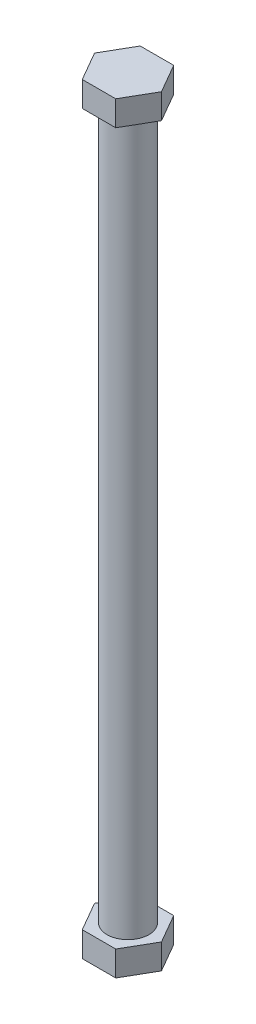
ISO-10303-21;
HEADER;
FILE_DESCRIPTION(('STEP AP214'),'2;1');
FILE_NAME('part.step','',(''),(''),'','','');
FILE_SCHEMA(('AUTOMOTIVE_DESIGN { 1 0 10303 214 1 1 1 1 }'));
ENDSEC;
DATA;
#1=APPLICATION_CONTEXT('core data for automotive mechanical design processes');
#2=APPLICATION_PROTOCOL_DEFINITION('international standard','automotive_design',2000,#1);
#3=PRODUCT_CONTEXT('',#1,'mechanical');
#4=PRODUCT('Part','Part','',(#3));
#5=PRODUCT_RELATED_PRODUCT_CATEGORY('part','',(#4));
#6=PRODUCT_DEFINITION_FORMATION('','',#4);
#7=PRODUCT_DEFINITION_CONTEXT('part definition',#1,'design');
#8=PRODUCT_DEFINITION('design','',#6,#7);
#9=PRODUCT_DEFINITION_SHAPE('','',#8);
#10=(LENGTH_UNIT() NAMED_UNIT(*) SI_UNIT(.MILLI.,.METRE.));
#11=(NAMED_UNIT(*) PLANE_ANGLE_UNIT() SI_UNIT($,.RADIAN.));
#12=(NAMED_UNIT(*) SI_UNIT($,.STERADIAN.) SOLID_ANGLE_UNIT());
#13=UNCERTAINTY_MEASURE_WITH_UNIT(LENGTH_MEASURE(1.E-05),#10,'distance_accuracy_value','');
#14=(GEOMETRIC_REPRESENTATION_CONTEXT(3) GLOBAL_UNCERTAINTY_ASSIGNED_CONTEXT((#13)) GLOBAL_UNIT_ASSIGNED_CONTEXT((#10,
#11,#12)) REPRESENTATION_CONTEXT('',''));
#15=CARTESIAN_POINT('',(0.,0.,0.));
#16=DIRECTION('',(0.,0.,1.));
#17=DIRECTION('',(1.,0.,0.));
#18=AXIS2_PLACEMENT_3D('',#15,#16,#17);
#19=CARTESIAN_POINT('',(0.,-107.95,0.));
#20=DIRECTION('',(0.,1.,0.));
#21=DIRECTION('',(0.,0.,1.));
#22=AXIS2_PLACEMENT_3D('',#19,#20,#21);
#23=CYLINDRICAL_SURFACE('',#22,3.175);
#24=CARTESIAN_POINT('',(0.,-107.95,0.));
#25=DIRECTION('',(0.,1.,0.));
#26=DIRECTION('',(0.,0.,1.));
#27=AXIS2_PLACEMENT_3D('',#24,#25,#26);
#28=CIRCLE('',#27,3.175);
#29=CARTESIAN_POINT('',(0.,-107.95,3.175));
#30=VERTEX_POINT('',#29);
#31=EDGE_CURVE('E136',#30,#30,#28,.T.);
#32=ORIENTED_EDGE('',*,*,#31,.T.);
#33=EDGE_LOOP('',(#32));
#34=FACE_BOUND('',#33,.T.);
#35=CARTESIAN_POINT('',(0.,0.,0.));
#36=DIRECTION('',(0.,1.,0.));
#37=DIRECTION('',(0.,0.,1.));
#38=AXIS2_PLACEMENT_3D('',#35,#36,#37);
#39=CIRCLE('',#38,3.175);
#40=CARTESIAN_POINT('',(0.,0.,3.175));
#41=VERTEX_POINT('',#40);
#42=EDGE_CURVE('E11',#41,#41,#39,.T.);
#43=ORIENTED_EDGE('',*,*,#42,.F.);
#44=EDGE_LOOP('',(#43));
#45=FACE_BOUND('',#44,.T.);
#46=ADVANCED_FACE('F43',(#34,#45),#23,.T.);
#47=CARTESIAN_POINT('',(5.08,3.81,0.));
#48=DIRECTION('',(-0.866025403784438,0.,0.500000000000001));
#49=DIRECTION('',(0.500000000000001,0.,0.866025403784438));
#50=AXIS2_PLACEMENT_3D('',#47,#48,#49);
#51=PLANE('',#50);
#52=DIRECTION('',(-0.500000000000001,0.,-0.866025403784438));
#53=VECTOR('',#52,1.);
#54=CARTESIAN_POINT('',(5.08,0.,0.));
#55=LINE('',#54,#53);
#56=CARTESIAN_POINT('',(5.08,0.,0.));
#57=VERTEX_POINT('',#56);
#58=CARTESIAN_POINT('',(2.54,0.,-4.39940905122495));
#59=VERTEX_POINT('',#58);
#60=EDGE_CURVE('E132',#57,#59,#55,.T.);
#61=ORIENTED_EDGE('',*,*,#60,.T.);
#62=DIRECTION('',(0.,-1.,0.));
#63=VECTOR('',#62,1.);
#64=CARTESIAN_POINT('',(2.54,3.81,-4.39940905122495));
#65=LINE('',#64,#63);
#66=CARTESIAN_POINT('',(2.54,3.81,-4.39940905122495));
#67=VERTEX_POINT('',#66);
#68=EDGE_CURVE('E51',#67,#59,#65,.T.);
#69=ORIENTED_EDGE('',*,*,#68,.F.);
#70=DIRECTION('',(-0.500000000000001,0.,-0.866025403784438));
#71=VECTOR('',#70,1.);
#72=CARTESIAN_POINT('',(5.08,3.81,0.));
#73=LINE('',#72,#71);
#74=CARTESIAN_POINT('',(5.08,3.81,0.));
#75=VERTEX_POINT('',#74);
#76=EDGE_CURVE('E143',#75,#67,#73,.T.);
#77=ORIENTED_EDGE('',*,*,#76,.F.);
#78=DIRECTION('',(0.,-1.,0.));
#79=VECTOR('',#78,1.);
#80=CARTESIAN_POINT('',(5.08,3.81,0.));
#81=LINE('',#80,#79);
#82=EDGE_CURVE('E128',#75,#57,#81,.T.);
#83=ORIENTED_EDGE('',*,*,#82,.T.);
#84=EDGE_LOOP('',(#61,#69,#77,#83));
#85=FACE_BOUND('',#84,.T.);
#86=ADVANCED_FACE('F179',(#85),#51,.F.);
#87=CARTESIAN_POINT('',(2.54,3.81,-4.39940905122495));
#88=DIRECTION('',(0.,0.,1.));
#89=DIRECTION('',(1.,0.,0.));
#90=AXIS2_PLACEMENT_3D('',#87,#88,#89);
#91=PLANE('',#90);
#92=DIRECTION('',(-1.,0.,0.));
#93=VECTOR('',#92,1.);
#94=CARTESIAN_POINT('',(2.54,0.,-4.39940905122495));
#95=LINE('',#94,#93);
#96=CARTESIAN_POINT('',(-2.54,0.,-4.39940905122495));
#97=VERTEX_POINT('',#96);
#98=EDGE_CURVE('E135',#59,#97,#95,.T.);
#99=ORIENTED_EDGE('',*,*,#98,.T.);
#100=DIRECTION('',(0.,-1.,0.));
#101=VECTOR('',#100,1.);
#102=CARTESIAN_POINT('',(-2.54,3.81,-4.39940905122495));
#103=LINE('',#102,#101);
#104=CARTESIAN_POINT('',(-2.54,3.81,-4.39940905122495));
#105=VERTEX_POINT('',#104);
#106=EDGE_CURVE('E147',#105,#97,#103,.T.);
#107=ORIENTED_EDGE('',*,*,#106,.F.);
#108=DIRECTION('',(-1.,0.,0.));
#109=VECTOR('',#108,1.);
#110=CARTESIAN_POINT('',(2.54,3.81,-4.39940905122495));
#111=LINE('',#110,#109);
#112=EDGE_CURVE('E98',#67,#105,#111,.T.);
#113=ORIENTED_EDGE('',*,*,#112,.F.);
#114=ORIENTED_EDGE('',*,*,#68,.T.);
#115=EDGE_LOOP('',(#99,#107,#113,#114));
#116=FACE_BOUND('',#115,.T.);
#117=ADVANCED_FACE('F171',(#116),#91,.F.);
#118=CARTESIAN_POINT('',(-2.54,3.81,-4.39940905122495));
#119=DIRECTION('',(0.866025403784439,0.,0.5));
#120=DIRECTION('',(0.5,0.,-0.866025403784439));
#121=AXIS2_PLACEMENT_3D('',#118,#119,#120);
#122=PLANE('',#121);
#123=DIRECTION('',(-0.5,0.,0.866025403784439));
#124=VECTOR('',#123,1.);
#125=CARTESIAN_POINT('',(-2.54,0.,-4.39940905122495));
#126=LINE('',#125,#124);
#127=CARTESIAN_POINT('',(-5.08,0.,0.));
#128=VERTEX_POINT('',#127);
#129=EDGE_CURVE('E138',#97,#128,#126,.T.);
#130=ORIENTED_EDGE('',*,*,#129,.T.);
#131=DIRECTION('',(0.,-1.,0.));
#132=VECTOR('',#131,1.);
#133=CARTESIAN_POINT('',(-5.08,3.81,0.));
#134=LINE('',#133,#132);
#135=CARTESIAN_POINT('',(-5.08,3.81,0.));
#136=VERTEX_POINT('',#135);
#137=EDGE_CURVE('E123',#136,#128,#134,.T.);
#138=ORIENTED_EDGE('',*,*,#137,.F.);
#139=DIRECTION('',(-0.5,0.,0.866025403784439));
#140=VECTOR('',#139,1.);
#141=CARTESIAN_POINT('',(-2.54,3.81,-4.39940905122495));
#142=LINE('',#141,#140);
#143=EDGE_CURVE('E114',#105,#136,#142,.T.);
#144=ORIENTED_EDGE('',*,*,#143,.F.);
#145=ORIENTED_EDGE('',*,*,#106,.T.);
#146=EDGE_LOOP('',(#130,#138,#144,#145));
#147=FACE_BOUND('',#146,.T.);
#148=ADVANCED_FACE('F174',(#147),#122,.F.);
#149=CARTESIAN_POINT('',(-5.08,3.81,0.));
#150=DIRECTION('',(0.866025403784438,0.,-0.5));
#151=DIRECTION('',(-0.5,0.,-0.866025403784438));
#152=AXIS2_PLACEMENT_3D('',#149,#150,#151);
#153=PLANE('',#152);
#154=DIRECTION('',(0.5,0.,0.866025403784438));
#155=VECTOR('',#154,1.);
#156=CARTESIAN_POINT('',(-5.08,0.,0.));
#157=LINE('',#156,#155);
#158=CARTESIAN_POINT('',(-2.53999999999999,0.,4.39940905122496));
#159=VERTEX_POINT('',#158);
#160=EDGE_CURVE('E122',#128,#159,#157,.T.);
#161=ORIENTED_EDGE('',*,*,#160,.T.);
#162=DIRECTION('',(0.,-1.,0.));
#163=VECTOR('',#162,1.);
#164=CARTESIAN_POINT('',(-2.53999999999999,3.81,4.39940905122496));
#165=LINE('',#164,#163);
#166=CARTESIAN_POINT('',(-2.53999999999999,3.81,4.39940905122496));
#167=VERTEX_POINT('',#166);
#168=EDGE_CURVE('E119',#167,#159,#165,.T.);
#169=ORIENTED_EDGE('',*,*,#168,.F.);
#170=DIRECTION('',(0.5,0.,0.866025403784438));
#171=VECTOR('',#170,1.);
#172=CARTESIAN_POINT('',(-5.08,3.81,0.));
#173=LINE('',#172,#171);
#174=EDGE_CURVE('E108',#136,#167,#173,.T.);
#175=ORIENTED_EDGE('',*,*,#174,.F.);
#176=ORIENTED_EDGE('',*,*,#137,.T.);
#177=EDGE_LOOP('',(#161,#169,#175,#176));
#178=FACE_BOUND('',#177,.T.);
#179=ADVANCED_FACE('F120',(#178),#153,.F.);
#180=CARTESIAN_POINT('',(-2.53999999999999,3.81,4.39940905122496));
#181=DIRECTION('',(0.,0.,-1.));
#182=DIRECTION('',(-1.,0.,0.));
#183=AXIS2_PLACEMENT_3D('',#180,#181,#182);
#184=PLANE('',#183);
#185=DIRECTION('',(1.,0.,0.));
#186=VECTOR('',#185,1.);
#187=CARTESIAN_POINT('',(-2.53999999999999,0.,4.39940905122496));
#188=LINE('',#187,#186);
#189=CARTESIAN_POINT('',(2.54,0.,4.39940905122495));
#190=VERTEX_POINT('',#189);
#191=EDGE_CURVE('E83',#159,#190,#188,.T.);
#192=ORIENTED_EDGE('',*,*,#191,.T.);
#193=DIRECTION('',(0.,-1.,0.));
#194=VECTOR('',#193,1.);
#195=CARTESIAN_POINT('',(2.54,3.81,4.39940905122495));
#196=LINE('',#195,#194);
#197=CARTESIAN_POINT('',(2.54,3.81,4.39940905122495));
#198=VERTEX_POINT('',#197);
#199=EDGE_CURVE('E124',#198,#190,#196,.T.);
#200=ORIENTED_EDGE('',*,*,#199,.F.);
#201=DIRECTION('',(1.,0.,0.));
#202=VECTOR('',#201,1.);
#203=CARTESIAN_POINT('',(-2.53999999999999,3.81,4.39940905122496));
#204=LINE('',#203,#202);
#205=EDGE_CURVE('E112',#167,#198,#204,.T.);
#206=ORIENTED_EDGE('',*,*,#205,.F.);
#207=ORIENTED_EDGE('',*,*,#168,.T.);
#208=EDGE_LOOP('',(#192,#200,#206,#207));
#209=FACE_BOUND('',#208,.T.);
#210=ADVANCED_FACE('F126',(#209),#184,.F.);
#211=CARTESIAN_POINT('',(2.54,3.81,4.39940905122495));
#212=DIRECTION('',(-0.866025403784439,0.,-0.5));
#213=DIRECTION('',(-0.5,0.,0.866025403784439));
#214=AXIS2_PLACEMENT_3D('',#211,#212,#213);
#215=PLANE('',#214);
#216=DIRECTION('',(0.5,0.,-0.866025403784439));
#217=VECTOR('',#216,1.);
#218=CARTESIAN_POINT('',(2.54,0.,4.39940905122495));
#219=LINE('',#218,#217);
#220=EDGE_CURVE('E89',#190,#57,#219,.T.);
#221=ORIENTED_EDGE('',*,*,#220,.T.);
#222=ORIENTED_EDGE('',*,*,#82,.F.);
#223=DIRECTION('',(0.5,0.,-0.866025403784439));
#224=VECTOR('',#223,1.);
#225=CARTESIAN_POINT('',(2.54,3.81,4.39940905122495));
#226=LINE('',#225,#224);
#227=EDGE_CURVE('E59',#198,#75,#226,.T.);
#228=ORIENTED_EDGE('',*,*,#227,.F.);
#229=ORIENTED_EDGE('',*,*,#199,.T.);
#230=EDGE_LOOP('',(#221,#222,#228,#229));
#231=FACE_BOUND('',#230,.T.);
#232=ADVANCED_FACE('F180',(#231),#215,.F.);
#233=CARTESIAN_POINT('',(0.,3.81,0.));
#234=DIRECTION('',(0.,1.,0.));
#235=DIRECTION('',(0.,0.,1.));
#236=AXIS2_PLACEMENT_3D('',#233,#234,#235);
#237=PLANE('',#236);
#238=ORIENTED_EDGE('',*,*,#76,.T.);
#239=ORIENTED_EDGE('',*,*,#112,.T.);
#240=ORIENTED_EDGE('',*,*,#143,.T.);
#241=ORIENTED_EDGE('',*,*,#174,.T.);
#242=ORIENTED_EDGE('',*,*,#205,.T.);
#243=ORIENTED_EDGE('',*,*,#227,.T.);
#244=EDGE_LOOP('',(#238,#239,#240,#241,#242,#243));
#245=FACE_BOUND('',#244,.T.);
#246=ADVANCED_FACE('F110',(#245),#237,.T.);
#247=CARTESIAN_POINT('',(0.,0.,0.));
#248=DIRECTION('',(0.,1.,0.));
#249=DIRECTION('',(0.,0.,1.));
#250=AXIS2_PLACEMENT_3D('',#247,#248,#249);
#251=PLANE('',#250);
#252=ORIENTED_EDGE('',*,*,#42,.T.);
#253=EDGE_LOOP('',(#252));
#254=FACE_BOUND('',#253,.T.);
#255=ORIENTED_EDGE('',*,*,#60,.F.);
#256=ORIENTED_EDGE('',*,*,#220,.F.);
#257=ORIENTED_EDGE('',*,*,#191,.F.);
#258=ORIENTED_EDGE('',*,*,#160,.F.);
#259=ORIENTED_EDGE('',*,*,#129,.F.);
#260=ORIENTED_EDGE('',*,*,#98,.F.);
#261=EDGE_LOOP('',(#255,#256,#257,#258,#259,#260));
#262=FACE_BOUND('',#261,.T.);
#263=ADVANCED_FACE('F177',(#254,#262),#251,.F.);
#264=CARTESIAN_POINT('',(5.08,-111.76,0.));
#265=DIRECTION('',(-0.866025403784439,0.,-0.499999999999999));
#266=DIRECTION('',(-0.499999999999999,0.,0.866025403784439));
#267=AXIS2_PLACEMENT_3D('',#264,#265,#266);
#268=PLANE('',#267);
#269=DIRECTION('',(-0.499999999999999,0.,0.866025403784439));
#270=VECTOR('',#269,1.);
#271=CARTESIAN_POINT('',(5.08,-107.95,0.));
#272=LINE('',#271,#270);
#273=CARTESIAN_POINT('',(5.08,-107.95,0.));
#274=VERTEX_POINT('',#273);
#275=CARTESIAN_POINT('',(2.54000000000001,-107.95,4.39940905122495));
#276=VERTEX_POINT('',#275);
#277=EDGE_CURVE('E252',#274,#276,#272,.T.);
#278=ORIENTED_EDGE('',*,*,#277,.T.);
#279=DIRECTION('',(0.,1.,0.));
#280=VECTOR('',#279,1.);
#281=CARTESIAN_POINT('',(2.54000000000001,-111.76,4.39940905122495));
#282=LINE('',#281,#280);
#283=CARTESIAN_POINT('',(2.54000000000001,-111.76,4.39940905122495));
#284=VERTEX_POINT('',#283);
#285=EDGE_CURVE('E151',#284,#276,#282,.T.);
#286=ORIENTED_EDGE('',*,*,#285,.F.);
#287=DIRECTION('',(-0.499999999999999,0.,0.866025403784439));
#288=VECTOR('',#287,1.);
#289=CARTESIAN_POINT('',(5.08,-111.76,0.));
#290=LINE('',#289,#288);
#291=CARTESIAN_POINT('',(5.08,-111.76,0.));
#292=VERTEX_POINT('',#291);
#293=EDGE_CURVE('E238',#292,#284,#290,.T.);
#294=ORIENTED_EDGE('',*,*,#293,.F.);
#295=DIRECTION('',(0.,1.,0.));
#296=VECTOR('',#295,1.);
#297=CARTESIAN_POINT('',(5.08,-111.76,0.));
#298=LINE('',#297,#296);
#299=EDGE_CURVE('E253',#292,#274,#298,.T.);
#300=ORIENTED_EDGE('',*,*,#299,.T.);
#301=EDGE_LOOP('',(#278,#286,#294,#300));
#302=FACE_BOUND('',#301,.T.);
#303=ADVANCED_FACE('F198',(#302),#268,.F.);
#304=CARTESIAN_POINT('',(2.54000000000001,-111.76,4.39940905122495));
#305=DIRECTION('',(0.,0.,-1.));
#306=DIRECTION('',(-1.,0.,0.));
#307=AXIS2_PLACEMENT_3D('',#304,#305,#306);
#308=PLANE('',#307);
#309=DIRECTION('',(-1.,0.,0.));
#310=VECTOR('',#309,1.);
#311=CARTESIAN_POINT('',(2.54000000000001,-107.95,4.39940905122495));
#312=LINE('',#311,#310);
#313=CARTESIAN_POINT('',(-2.53999999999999,-107.95,4.39940905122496));
#314=VERTEX_POINT('',#313);
#315=EDGE_CURVE('E259',#276,#314,#312,.T.);
#316=ORIENTED_EDGE('',*,*,#315,.T.);
#317=DIRECTION('',(0.,1.,0.));
#318=VECTOR('',#317,1.);
#319=CARTESIAN_POINT('',(-2.53999999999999,-111.76,4.39940905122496));
#320=LINE('',#319,#318);
#321=CARTESIAN_POINT('',(-2.53999999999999,-111.76,4.39940905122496));
#322=VERTEX_POINT('',#321);
#323=EDGE_CURVE('E155',#322,#314,#320,.T.);
#324=ORIENTED_EDGE('',*,*,#323,.F.);
#325=DIRECTION('',(-1.,0.,0.));
#326=VECTOR('',#325,1.);
#327=CARTESIAN_POINT('',(2.54000000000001,-111.76,4.39940905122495));
#328=LINE('',#327,#326);
#329=EDGE_CURVE('E241',#284,#322,#328,.T.);
#330=ORIENTED_EDGE('',*,*,#329,.F.);
#331=ORIENTED_EDGE('',*,*,#285,.T.);
#332=EDGE_LOOP('',(#316,#324,#330,#331));
#333=FACE_BOUND('',#332,.T.);
#334=ADVANCED_FACE('F202',(#333),#308,.F.);
#335=CARTESIAN_POINT('',(-2.53999999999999,-111.76,4.39940905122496));
#336=DIRECTION('',(0.866025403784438,0.,-0.500000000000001));
#337=DIRECTION('',(-0.500000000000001,0.,-0.866025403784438));
#338=AXIS2_PLACEMENT_3D('',#335,#336,#337);
#339=PLANE('',#338);
#340=DIRECTION('',(-0.500000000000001,0.,-0.866025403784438));
#341=VECTOR('',#340,1.);
#342=CARTESIAN_POINT('',(-2.53999999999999,-107.95,4.39940905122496));
#343=LINE('',#342,#341);
#344=CARTESIAN_POINT('',(-5.08,-107.95,0.));
#345=VERTEX_POINT('',#344);
#346=EDGE_CURVE('E261',#314,#345,#343,.T.);
#347=ORIENTED_EDGE('',*,*,#346,.T.);
#348=DIRECTION('',(0.,1.,0.));
#349=VECTOR('',#348,1.);
#350=CARTESIAN_POINT('',(-5.08,-111.76,0.));
#351=LINE('',#350,#349);
#352=CARTESIAN_POINT('',(-5.08,-111.76,0.));
#353=VERTEX_POINT('',#352);
#354=EDGE_CURVE('E164',#353,#345,#351,.T.);
#355=ORIENTED_EDGE('',*,*,#354,.F.);
#356=DIRECTION('',(-0.500000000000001,0.,-0.866025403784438));
#357=VECTOR('',#356,1.);
#358=CARTESIAN_POINT('',(-2.53999999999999,-111.76,4.39940905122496));
#359=LINE('',#358,#357);
#360=EDGE_CURVE('E304',#322,#353,#359,.T.);
#361=ORIENTED_EDGE('',*,*,#360,.F.);
#362=ORIENTED_EDGE('',*,*,#323,.T.);
#363=EDGE_LOOP('',(#347,#355,#361,#362));
#364=FACE_BOUND('',#363,.T.);
#365=ADVANCED_FACE('F208',(#364),#339,.F.);
#366=CARTESIAN_POINT('',(-5.08,-111.76,0.));
#367=DIRECTION('',(0.866025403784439,0.,0.499999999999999));
#368=DIRECTION('',(0.499999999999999,0.,-0.866025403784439));
#369=AXIS2_PLACEMENT_3D('',#366,#367,#368);
#370=PLANE('',#369);
#371=DIRECTION('',(0.499999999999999,0.,-0.866025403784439));
#372=VECTOR('',#371,1.);
#373=CARTESIAN_POINT('',(-5.08,-107.95,0.));
#374=LINE('',#373,#372);
#375=CARTESIAN_POINT('',(-2.54000000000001,-107.95,-4.39940905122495));
#376=VERTEX_POINT('',#375);
#377=EDGE_CURVE('E268',#345,#376,#374,.T.);
#378=ORIENTED_EDGE('',*,*,#377,.T.);
#379=DIRECTION('',(0.,1.,0.));
#380=VECTOR('',#379,1.);
#381=CARTESIAN_POINT('',(-2.54000000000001,-111.76,-4.39940905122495));
#382=LINE('',#381,#380);
#383=CARTESIAN_POINT('',(-2.54000000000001,-111.76,-4.39940905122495));
#384=VERTEX_POINT('',#383);
#385=EDGE_CURVE('E280',#384,#376,#382,.T.);
#386=ORIENTED_EDGE('',*,*,#385,.F.);
#387=DIRECTION('',(0.499999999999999,0.,-0.866025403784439));
#388=VECTOR('',#387,1.);
#389=CARTESIAN_POINT('',(-5.08,-111.76,0.));
#390=LINE('',#389,#388);
#391=EDGE_CURVE('E291',#353,#384,#390,.T.);
#392=ORIENTED_EDGE('',*,*,#391,.F.);
#393=ORIENTED_EDGE('',*,*,#354,.T.);
#394=EDGE_LOOP('',(#378,#386,#392,#393));
#395=FACE_BOUND('',#394,.T.);
#396=ADVANCED_FACE('F211',(#395),#370,.F.);
#397=CARTESIAN_POINT('',(-2.54000000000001,-111.76,-4.39940905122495));
#398=DIRECTION('',(0.,0.,1.));
#399=DIRECTION('',(1.,0.,0.));
#400=AXIS2_PLACEMENT_3D('',#397,#398,#399);
#401=PLANE('',#400);
#402=DIRECTION('',(1.,0.,0.));
#403=VECTOR('',#402,1.);
#404=CARTESIAN_POINT('',(-2.54000000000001,-107.95,-4.39940905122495));
#405=LINE('',#404,#403);
#406=CARTESIAN_POINT('',(2.53999999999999,-107.95,-4.39940905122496));
#407=VERTEX_POINT('',#406);
#408=EDGE_CURVE('E271',#376,#407,#405,.T.);
#409=ORIENTED_EDGE('',*,*,#408,.T.);
#410=DIRECTION('',(0.,1.,0.));
#411=VECTOR('',#410,1.);
#412=CARTESIAN_POINT('',(2.53999999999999,-111.76,-4.39940905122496));
#413=LINE('',#412,#411);
#414=CARTESIAN_POINT('',(2.53999999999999,-111.76,-4.39940905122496));
#415=VERTEX_POINT('',#414);
#416=EDGE_CURVE('E277',#415,#407,#413,.T.);
#417=ORIENTED_EDGE('',*,*,#416,.F.);
#418=DIRECTION('',(1.,0.,0.));
#419=VECTOR('',#418,1.);
#420=CARTESIAN_POINT('',(-2.54000000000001,-111.76,-4.39940905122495));
#421=LINE('',#420,#419);
#422=EDGE_CURVE('E303',#384,#415,#421,.T.);
#423=ORIENTED_EDGE('',*,*,#422,.F.);
#424=ORIENTED_EDGE('',*,*,#385,.T.);
#425=EDGE_LOOP('',(#409,#417,#423,#424));
#426=FACE_BOUND('',#425,.T.);
#427=ADVANCED_FACE('F215',(#426),#401,.F.);
#428=CARTESIAN_POINT('',(2.53999999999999,-111.76,-4.39940905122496));
#429=DIRECTION('',(-0.866025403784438,0.,0.500000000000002));
#430=DIRECTION('',(0.500000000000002,0.,0.866025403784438));
#431=AXIS2_PLACEMENT_3D('',#428,#429,#430);
#432=PLANE('',#431);
#433=DIRECTION('',(0.500000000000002,0.,0.866025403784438));
#434=VECTOR('',#433,1.);
#435=CARTESIAN_POINT('',(2.53999999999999,-107.95,-4.39940905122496));
#436=LINE('',#435,#434);
#437=EDGE_CURVE('E249',#407,#274,#436,.T.);
#438=ORIENTED_EDGE('',*,*,#437,.T.);
#439=ORIENTED_EDGE('',*,*,#299,.F.);
#440=DIRECTION('',(0.500000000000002,0.,0.866025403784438));
#441=VECTOR('',#440,1.);
#442=CARTESIAN_POINT('',(2.53999999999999,-111.76,-4.39940905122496));
#443=LINE('',#442,#441);
#444=EDGE_CURVE('E245',#415,#292,#443,.T.);
#445=ORIENTED_EDGE('',*,*,#444,.F.);
#446=ORIENTED_EDGE('',*,*,#416,.T.);
#447=EDGE_LOOP('',(#438,#439,#445,#446));
#448=FACE_BOUND('',#447,.T.);
#449=ADVANCED_FACE('F219',(#448),#432,.F.);
#450=CARTESIAN_POINT('',(0.,-111.76,0.));
#451=DIRECTION('',(0.,-1.,0.));
#452=DIRECTION('',(0.,0.,-1.));
#453=AXIS2_PLACEMENT_3D('',#450,#451,#452);
#454=PLANE('',#453);
#455=ORIENTED_EDGE('',*,*,#293,.T.);
#456=ORIENTED_EDGE('',*,*,#329,.T.);
#457=ORIENTED_EDGE('',*,*,#360,.T.);
#458=ORIENTED_EDGE('',*,*,#391,.T.);
#459=ORIENTED_EDGE('',*,*,#422,.T.);
#460=ORIENTED_EDGE('',*,*,#444,.T.);
#461=EDGE_LOOP('',(#455,#456,#457,#458,#459,#460));
#462=FACE_BOUND('',#461,.T.);
#463=ADVANCED_FACE('F223',(#462),#454,.T.);
#464=CARTESIAN_POINT('',(0.,-107.95,0.));
#465=DIRECTION('',(0.,-1.,0.));
#466=DIRECTION('',(0.,0.,-1.));
#467=AXIS2_PLACEMENT_3D('',#464,#465,#466);
#468=PLANE('',#467);
#469=ORIENTED_EDGE('',*,*,#31,.F.);
#470=EDGE_LOOP('',(#469));
#471=FACE_BOUND('',#470,.T.);
#472=ORIENTED_EDGE('',*,*,#277,.F.);
#473=ORIENTED_EDGE('',*,*,#437,.F.);
#474=ORIENTED_EDGE('',*,*,#408,.F.);
#475=ORIENTED_EDGE('',*,*,#377,.F.);
#476=ORIENTED_EDGE('',*,*,#346,.F.);
#477=ORIENTED_EDGE('',*,*,#315,.F.);
#478=EDGE_LOOP('',(#472,#473,#474,#475,#476,#477));
#479=FACE_BOUND('',#478,.T.);
#480=ADVANCED_FACE('F225',(#471,#479),#468,.F.);
#481=CLOSED_SHELL('',(#46,#86,#117,#148,#179,#210,#232,#246,#263,#303,#334,#365,#396,#427,#449,
#463,#480));
#482=MANIFOLD_SOLID_BREP('B2',#481);
#483=ADVANCED_BREP_SHAPE_REPRESENTATION('',(#18,#482),#14);
#484=SHAPE_DEFINITION_REPRESENTATION(#9,#483);
ENDSEC;
END-ISO-10303-21;
